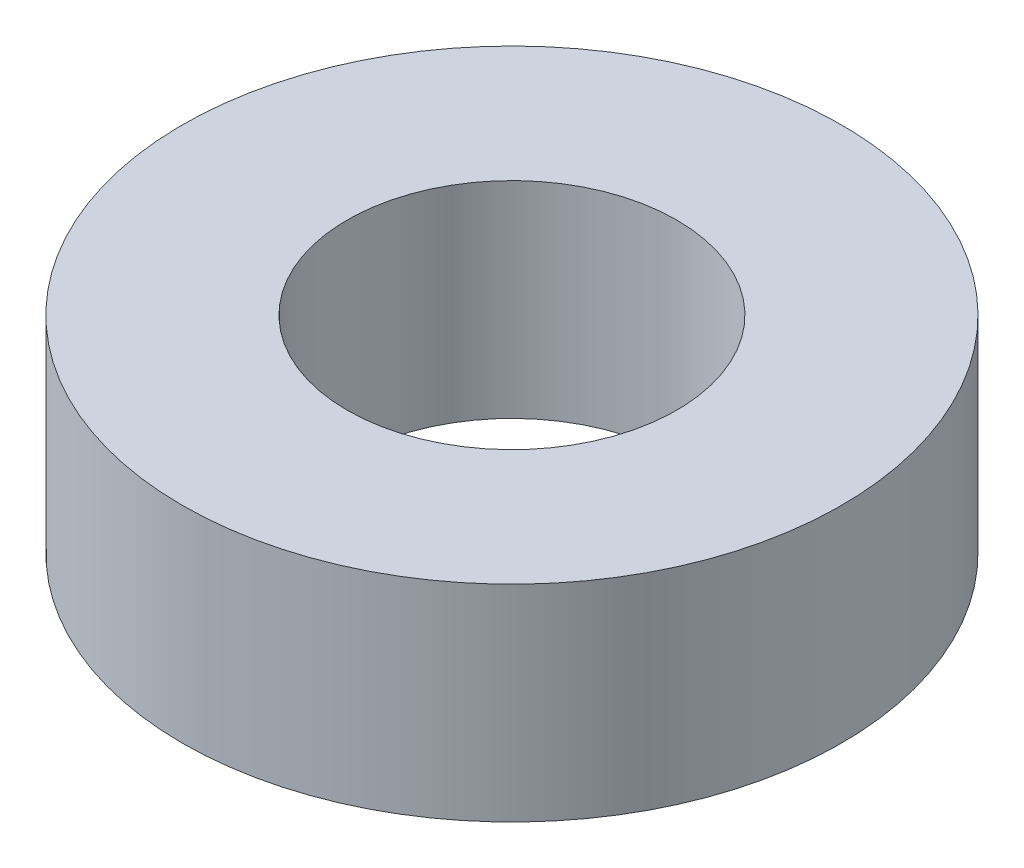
from build123d import *

# Parameters (mm, degrees)
SKETCH_1_R      = 8
SKETCH_1_R_2    = 4
EXTRUDE_1_DEPTH = 5


with BuildPart() as part:
    # Sketch 1 → Extrude 1 (new body)
    with BuildSketch(Plane(origin=(0, 0, 0), x_dir=(1, 0, 0), z_dir=(0, 1, 0))):
        with Locations(Location((0, 0, 0), (0, 0, 270))):
            Circle(SKETCH_1_R)
        with Locations(Location((0, 0, 0), (0, 0, 270))):
            Circle(SKETCH_1_R_2, mode=Mode.SUBTRACT)
    extrude(amount=EXTRUDE_1_DEPTH)


solid = part.part
